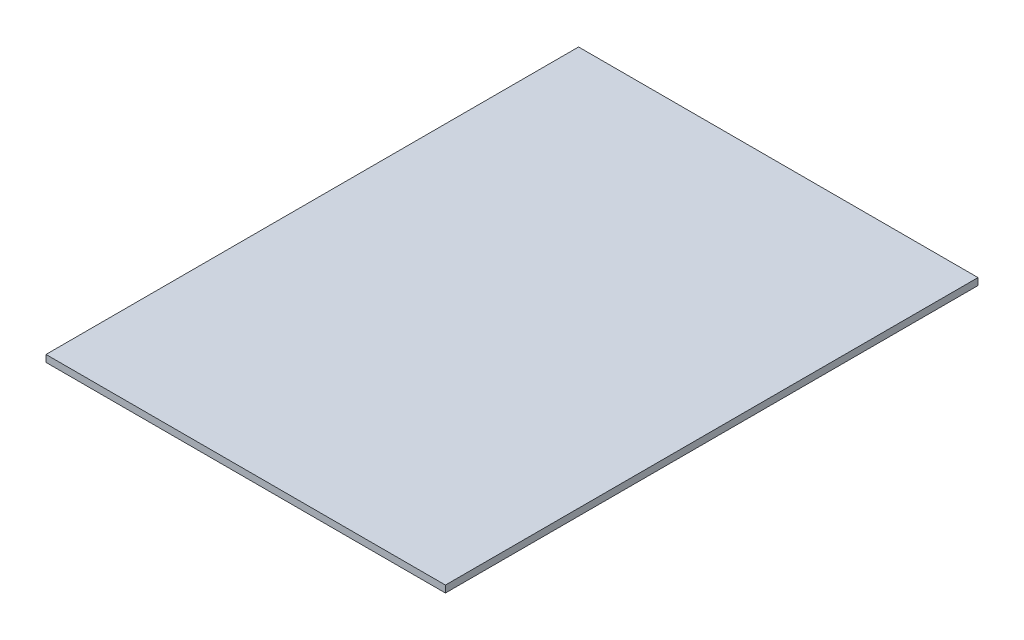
from build123d import *

# Parameters (mm, degrees)
SKETCH1_W           = 685.8
SKETCH1_H           = 914.4
BOSS_EXTRUDE1_DEPTH = 11.90625


with BuildPart() as part:
    # Sketch1 → Boss-Extrude1 (new body)
    with BuildSketch(Plane(origin=(0, 0, 0), x_dir=(1, 0, 0), z_dir=(0, 1, 0))):
        Rectangle(SKETCH1_W, SKETCH1_H)
    extrude(amount=BOSS_EXTRUDE1_DEPTH)


solid = part.part
